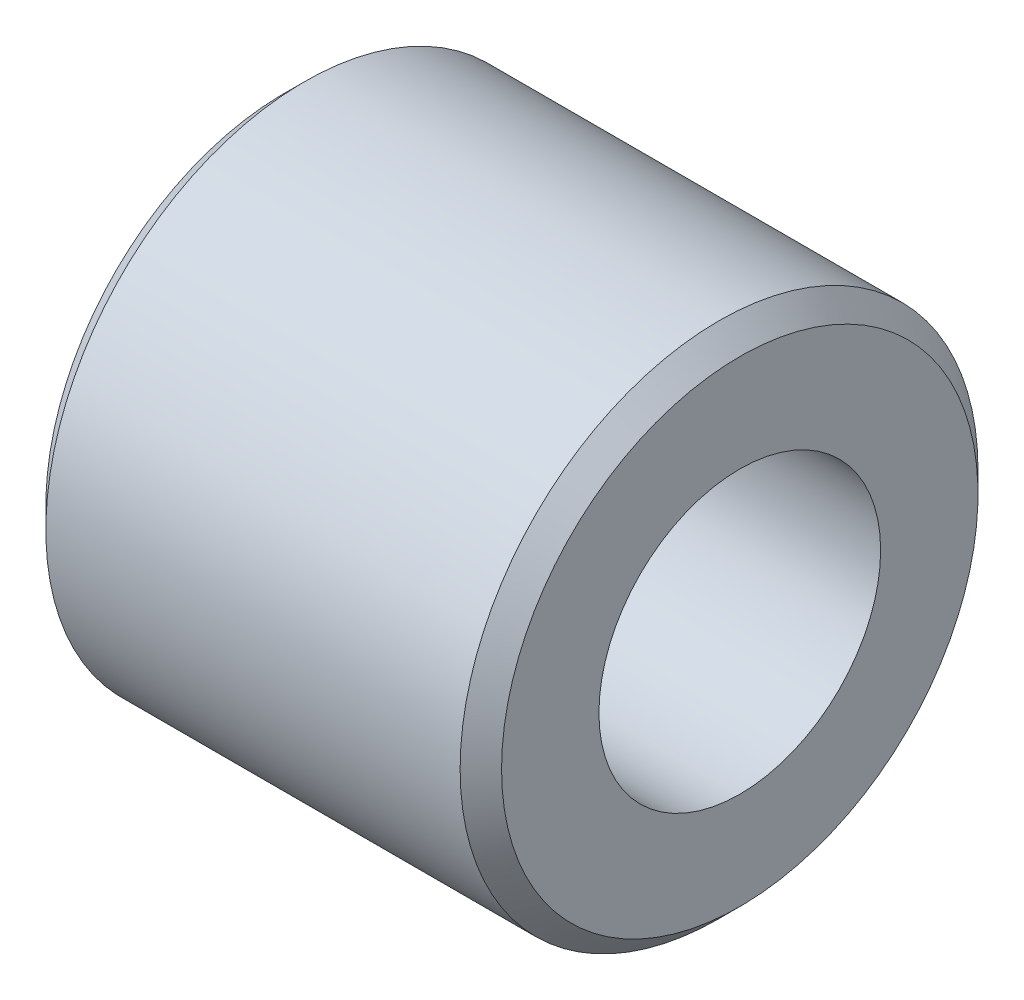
ISO-10303-21;
HEADER;
FILE_DESCRIPTION(('STEP AP214'),'2;1');
FILE_NAME('part.step','',(''),(''),'','','');
FILE_SCHEMA(('AUTOMOTIVE_DESIGN { 1 0 10303 214 1 1 1 1 }'));
ENDSEC;
DATA;
#1=APPLICATION_CONTEXT('core data for automotive mechanical design processes');
#2=APPLICATION_PROTOCOL_DEFINITION('international standard','automotive_design',2000,#1);
#3=PRODUCT_CONTEXT('',#1,'mechanical');
#4=PRODUCT('Part','Part','',(#3));
#5=PRODUCT_RELATED_PRODUCT_CATEGORY('part','',(#4));
#6=PRODUCT_DEFINITION_FORMATION('','',#4);
#7=PRODUCT_DEFINITION_CONTEXT('part definition',#1,'design');
#8=PRODUCT_DEFINITION('design','',#6,#7);
#9=PRODUCT_DEFINITION_SHAPE('','',#8);
#10=(LENGTH_UNIT() NAMED_UNIT(*) SI_UNIT(.MILLI.,.METRE.));
#11=(NAMED_UNIT(*) PLANE_ANGLE_UNIT() SI_UNIT($,.RADIAN.));
#12=(NAMED_UNIT(*) SI_UNIT($,.STERADIAN.) SOLID_ANGLE_UNIT());
#13=UNCERTAINTY_MEASURE_WITH_UNIT(LENGTH_MEASURE(1.E-05),#10,'distance_accuracy_value','');
#14=(GEOMETRIC_REPRESENTATION_CONTEXT(3) GLOBAL_UNCERTAINTY_ASSIGNED_CONTEXT((#13)) GLOBAL_UNIT_ASSIGNED_CONTEXT((#10,
#11,#12)) REPRESENTATION_CONTEXT('',''));
#15=CARTESIAN_POINT('',(0.,0.,0.));
#16=DIRECTION('',(0.,0.,1.));
#17=DIRECTION('',(1.,0.,0.));
#18=AXIS2_PLACEMENT_3D('',#15,#16,#17);
#19=CARTESIAN_POINT('',(-0.698500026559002,0.,0.));
#20=DIRECTION('',(1.,0.,0.));
#21=DIRECTION('',(0.,0.,-1.));
#22=AXIS2_PLACEMENT_3D('',#19,#20,#21);
#23=CYLINDRICAL_SURFACE('',#22,1.7272);
#24=CARTESIAN_POINT('',(0.,0.,0.));
#25=DIRECTION('',(1.,0.,0.));
#26=DIRECTION('',(0.,0.,-1.));
#27=AXIS2_PLACEMENT_3D('',#24,#25,#26);
#28=CIRCLE('',#27,1.7272);
#29=CARTESIAN_POINT('',(0.,0.,-1.7272));
#30=VERTEX_POINT('',#29);
#31=EDGE_CURVE('E18',#30,#30,#28,.F.);
#32=ORIENTED_EDGE('',*,*,#31,.T.);
#33=EDGE_LOOP('',(#32));
#34=FACE_BOUND('',#33,.T.);
#35=CARTESIAN_POINT('',(5.588,0.,0.));
#36=DIRECTION('',(1.,0.,0.));
#37=DIRECTION('',(0.,0.,-1.));
#38=AXIS2_PLACEMENT_3D('',#35,#36,#37);
#39=CIRCLE('',#38,1.7272);
#40=CARTESIAN_POINT('',(5.588,0.,-1.7272));
#41=VERTEX_POINT('',#40);
#42=EDGE_CURVE('E34',#41,#41,#39,.F.);
#43=ORIENTED_EDGE('',*,*,#42,.F.);
#44=EDGE_LOOP('',(#43));
#45=FACE_BOUND('',#44,.T.);
#46=ADVANCED_FACE('F15',(#34,#45),#23,.F.);
#47=CARTESIAN_POINT('',(0.,0.,0.));
#48=DIRECTION('',(1.,0.,0.));
#49=DIRECTION('',(0.,0.,-1.));
#50=AXIS2_PLACEMENT_3D('',#47,#48,#49);
#51=PLANE('',#50);
#52=ORIENTED_EDGE('',*,*,#31,.F.);
#53=EDGE_LOOP('',(#52));
#54=FACE_BOUND('',#53,.T.);
#55=CARTESIAN_POINT('',(-5.6843418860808E-11,0.,0.));
#56=DIRECTION('',(1.,0.,0.));
#57=DIRECTION('',(0.,0.,-1.));
#58=AXIS2_PLACEMENT_3D('',#55,#56,#57);
#59=CIRCLE('',#58,2.92099999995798);
#60=CARTESIAN_POINT('',(-5.6843418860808E-11,0.,-2.92099999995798));
#61=VERTEX_POINT('',#60);
#62=EDGE_CURVE('E32',#61,#61,#59,.T.);
#63=ORIENTED_EDGE('',*,*,#62,.F.);
#64=EDGE_LOOP('',(#63));
#65=FACE_BOUND('',#64,.T.);
#66=ADVANCED_FACE('F43',(#54,#65),#51,.F.);
#67=CARTESIAN_POINT('',(5.588,0.,0.));
#68=DIRECTION('',(1.,0.,0.));
#69=DIRECTION('',(0.,0.,-1.));
#70=AXIS2_PLACEMENT_3D('',#67,#68,#69);
#71=PLANE('',#70);
#72=ORIENTED_EDGE('',*,*,#42,.T.);
#73=EDGE_LOOP('',(#72));
#74=FACE_BOUND('',#73,.T.);
#75=CARTESIAN_POINT('',(5.58800000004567,0.,0.));
#76=DIRECTION('',(-1.,0.,0.));
#77=DIRECTION('',(0.,0.,1.));
#78=AXIS2_PLACEMENT_3D('',#75,#76,#77);
#79=CIRCLE('',#78,2.92100000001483);
#80=CARTESIAN_POINT('',(5.58800000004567,0.,2.92100000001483));
#81=VERTEX_POINT('',#80);
#82=EDGE_CURVE('E27',#81,#81,#79,.T.);
#83=ORIENTED_EDGE('',*,*,#82,.F.);
#84=EDGE_LOOP('',(#83));
#85=FACE_BOUND('',#84,.T.);
#86=ADVANCED_FACE('F46',(#74,#85),#71,.T.);
#87=CARTESIAN_POINT('',(0.253999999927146,0.,0.));
#88=DIRECTION('',(1.,0.,0.));
#89=DIRECTION('',(0.,0.,-1.));
#90=AXIS2_PLACEMENT_3D('',#87,#88,#89);
#91=CONICAL_SURFACE('',#90,3.17499999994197,0.785398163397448);
#92=CARTESIAN_POINT('',(0.254,0.,0.));
#93=DIRECTION('',(1.,0.,0.));
#94=DIRECTION('',(0.,0.,-1.));
#95=AXIS2_PLACEMENT_3D('',#92,#93,#94);
#96=CIRCLE('',#95,3.175);
#97=CARTESIAN_POINT('',(0.254,0.,-3.175));
#98=VERTEX_POINT('',#97);
#99=EDGE_CURVE('E22',#98,#98,#96,.T.);
#100=ORIENTED_EDGE('',*,*,#99,.F.);
#101=EDGE_LOOP('',(#100));
#102=FACE_BOUND('',#101,.T.);
#103=ORIENTED_EDGE('',*,*,#62,.T.);
#104=EDGE_LOOP('',(#103));
#105=FACE_BOUND('',#104,.T.);
#106=ADVANCED_FACE('F49',(#102,#105),#91,.T.);
#107=CARTESIAN_POINT('',(5.33400000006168,0.,0.));
#108=DIRECTION('',(-1.,0.,0.));
#109=DIRECTION('',(0.,0.,1.));
#110=AXIS2_PLACEMENT_3D('',#107,#108,#109);
#111=CONICAL_SURFACE('',#110,3.17499999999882,0.785398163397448);
#112=CARTESIAN_POINT('',(5.334,0.,0.));
#113=DIRECTION('',(1.,0.,0.));
#114=DIRECTION('',(0.,0.,-1.));
#115=AXIS2_PLACEMENT_3D('',#112,#113,#114);
#116=CIRCLE('',#115,3.175);
#117=CARTESIAN_POINT('',(5.334,0.,-3.175));
#118=VERTEX_POINT('',#117);
#119=EDGE_CURVE('E10',#118,#118,#116,.F.);
#120=ORIENTED_EDGE('',*,*,#119,.F.);
#121=EDGE_LOOP('',(#120));
#122=FACE_BOUND('',#121,.T.);
#123=ORIENTED_EDGE('',*,*,#82,.T.);
#124=EDGE_LOOP('',(#123));
#125=FACE_BOUND('',#124,.T.);
#126=ADVANCED_FACE('F51',(#122,#125),#111,.T.);
#127=CARTESIAN_POINT('',(0.,0.,0.));
#128=DIRECTION('',(1.,0.,0.));
#129=DIRECTION('',(0.,0.,-1.));
#130=AXIS2_PLACEMENT_3D('',#127,#128,#129);
#131=CYLINDRICAL_SURFACE('',#130,3.175);
#132=ORIENTED_EDGE('',*,*,#99,.T.);
#133=EDGE_LOOP('',(#132));
#134=FACE_BOUND('',#133,.T.);
#135=ORIENTED_EDGE('',*,*,#119,.T.);
#136=EDGE_LOOP('',(#135));
#137=FACE_BOUND('',#136,.T.);
#138=ADVANCED_FACE('F59',(#134,#137),#131,.T.);
#139=CLOSED_SHELL('',(#46,#66,#86,#106,#126,#138));
#140=MANIFOLD_SOLID_BREP('B1',#139);
#141=ADVANCED_BREP_SHAPE_REPRESENTATION('',(#18,#140),#14);
#142=SHAPE_DEFINITION_REPRESENTATION(#9,#141);
ENDSEC;
END-ISO-10303-21;
